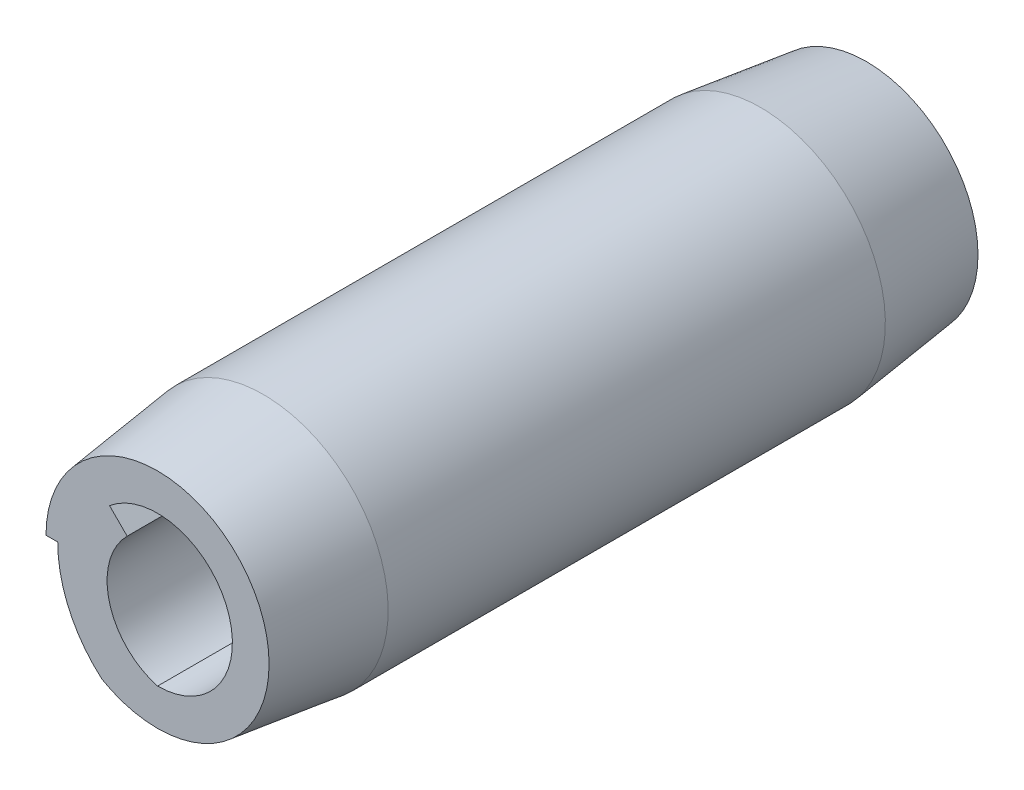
from build123d import *

# Parameters (mm, degrees)
BOSS_EXTRUDE1_DEPTH = 2.38125


with BuildPart() as part:
    # Sketch1 → Boss-Extrude1 (new, symmetric)
    with BuildSketch(Plane.XY):
        with BuildLine():
            Line((-0.8382, 0), (-0.67056, 0))
            ThreePointArc((-0.67056, 0), (-0.482292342, -0.536709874), (0, -0.8382))
            ThreePointArc((0, -0.8382), (0.592696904, 0.592696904), (-0.8382, 0))
        make_face()
        with BuildLine():
            Line((-0.322595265, 0.385824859), (-0.204055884, 0.267285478))
            ThreePointArc((-0.204055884, 0.267285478), (-0.32364561, -0.176531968), (0, -0.50292))
            ThreePointArc((0, -0.50292), (0.472740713, 0.171594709), (-0.322595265, 0.385824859))
        make_face(mode=Mode.SUBTRACT)
    extrude(amount=BOSS_EXTRUDE1_DEPTH, both=True)

    # ChamferSke → Chamfer 2 (revolve, cut)
    with BuildSketch(Plane(origin=(0, 0, 0), x_dir=(0, 0, -1), z_dir=(1, 0, 0))):
        Polygon((-2.38125, 1.466034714), (-2.38125, 0.7493), (-1.67005, 0.8382), (1.67005, 0.8382), (2.38125, 0.7493), (2.38125, 1.466034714), align=None)
    revolve(axis=Axis((0, 0, 0), (0, 0, 1)), mode=Mode.SUBTRACT)


solid = part.part
